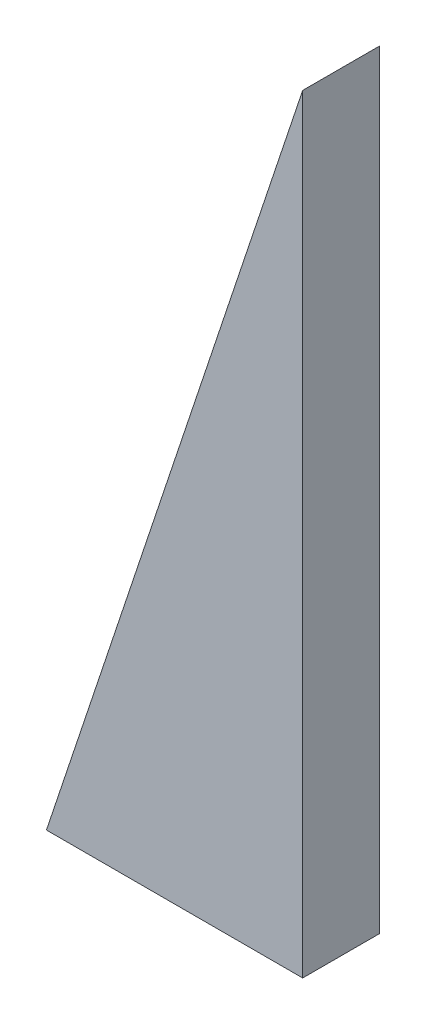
from build123d import *

# Parameters (mm, degrees)
BOSS_EXTRU_1_DEPTH = 3


with BuildPart() as part:
    # Esquisse1 → Boss.-Extru.1 (new body)
    with BuildSketch(Plane.XY):
        Polygon((0, 0), (10, 0), (10, 30), align=None)
    extrude(amount=BOSS_EXTRU_1_DEPTH)


solid = part.part
